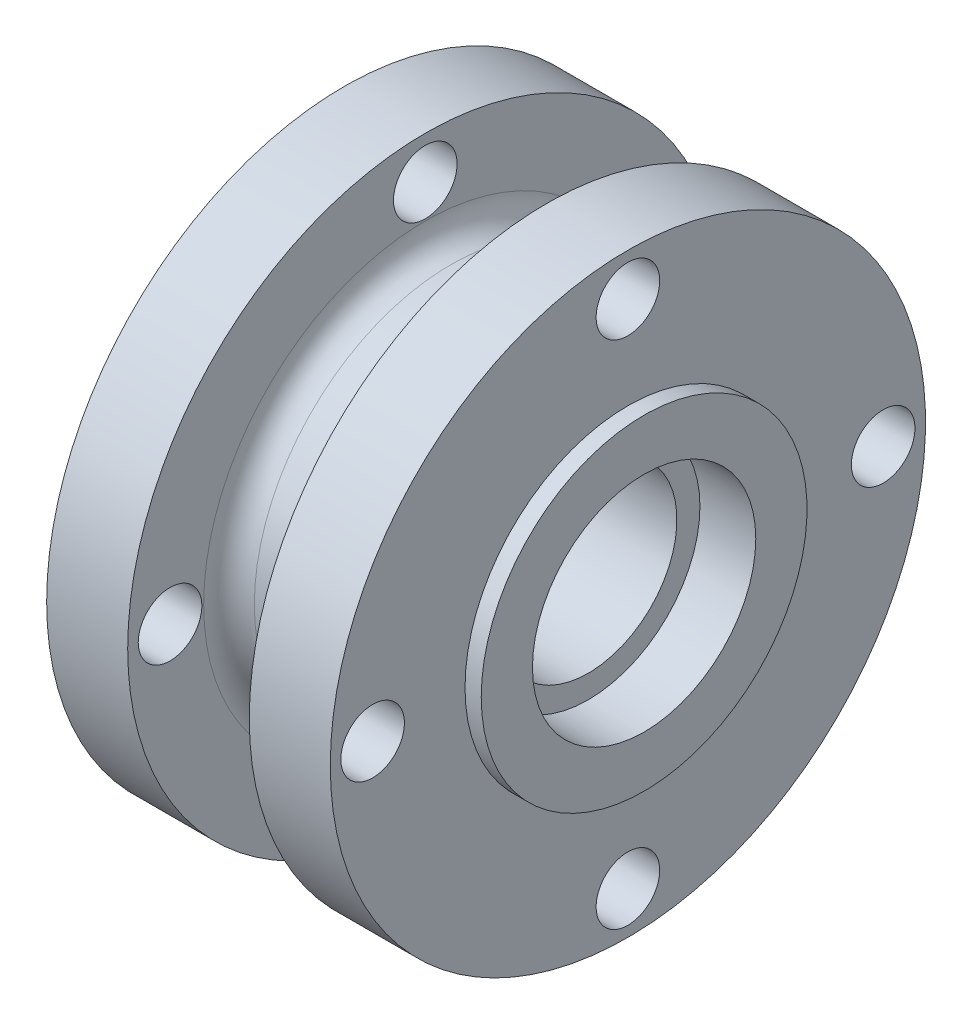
from build123d import *

# Parameters (mm, degrees)
CUT_EXTRUDE1_START = 17.78
SKETCH4_R          = 3.9878
CUT_EXTRUDE1_DEPTH = 25.4
SKETCH6_R          = 3.9878
CUT_EXTRUDE2_DEPTH = 12.7
FILLET1_R          = 3.175


with BuildPart() as part:
    # Sketch2 → Revolve1 (revolve)
    with BuildSketch(Plane.XY, mode=Mode.PRIVATE) as revolve1_sk:
        Polygon((7, 11.1125), (32.624, 11.1125), (32.624, 14), (39.624, 14), (39.624, 20.4216), (37.592, 20.4216), (37.592, 37.3126), (27.432, 37.3126), (27.432, 24.6126), (12.192, 24.6126), (12.192, 37.3126), (2.032, 37.3126), (2.032, 20.4216), (0, 20.4216), (0, 14), (7, 14), align=None)
    revolve(revolve1_sk.sketch.rotate(Axis((0, 0, 0), (1, 0, 0)), 90), axis=Axis((0, 0, 0), (1, 0, 0)))

    # Sketch4 → Cut-Extrude1 (cut)
    with BuildSketch(Plane(origin=(0, 0, 0), x_dir=(0, 0, -1), z_dir=(1, 0, 0)).offset(CUT_EXTRUDE1_START)):
        with Locations(Location((0, 32.004, 0), (0, 0, 180))):
            Circle(SKETCH4_R)
        with Locations(Location((32.004, 0, 0), (0, 0, 180))):
            Circle(SKETCH4_R)
        with Locations(Location((-32.004, 0, 0), (0, 0, 180))):
            Circle(SKETCH4_R)
        with Locations(Location((0, -32.004, 0), (0, 0, 180))):
            Circle(SKETCH4_R)
    extrude(amount=CUT_EXTRUDE1_DEPTH, mode=Mode.SUBTRACT)

    # Sketch6 → Cut-Extrude2 (cut)
    with BuildSketch(Plane(origin=(0, 0, 0), x_dir=(0, 0, -1), z_dir=(1, 0, 0))):
        with Locations(Location((0, -32.004, 0), (0, 0, 180))):
            Circle(SKETCH6_R)
        with Locations(Location((0, 32.004, 0), (0, 0, 180))):
            Circle(SKETCH6_R)
        with Locations(Location((-32.004, 0, 0), (0, 0, 180))):
            Circle(SKETCH6_R)
        with Locations(Location((32.004, 0, 0), (0, 0, 180))):
            Circle(SKETCH6_R)
    extrude(amount=CUT_EXTRUDE2_DEPTH, mode=Mode.SUBTRACT)

    # Fillet1
    fillet1_edges = [part.edges().sort_by_distance(p)[0] for p in [
        (12.192, 0, -24.6126),
        (27.432, 0, -24.6126),
    ]]
    fillet(fillet1_edges, radius=FILLET1_R)


solid = part.part
